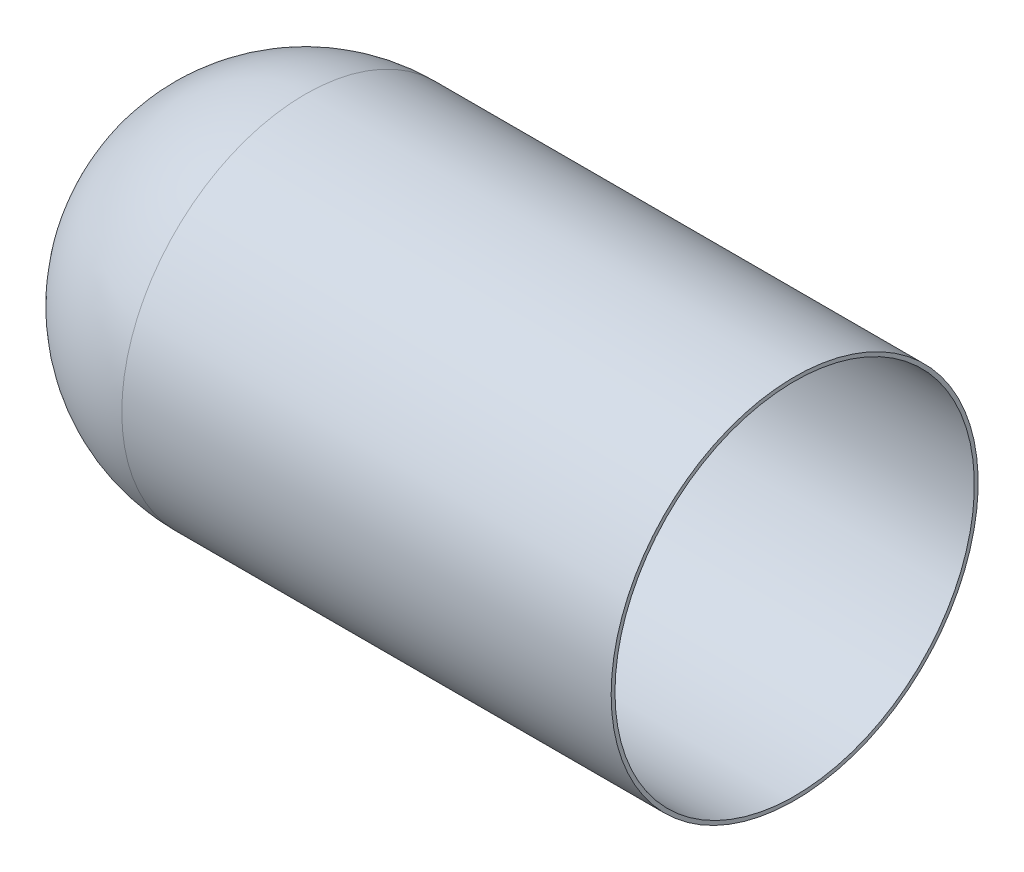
from build123d import *


with BuildPart() as part:
    # Sketch1 → Revolve1 (revolve)
    with BuildSketch(Plane.XY):
        with BuildLine():
            Line((0, 149.225), (-406.4, 149.225))
            ThreePointArc((-406.4, 149.225), (-487.083740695, 125.531807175), (-542.146366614, 61.976))
            ThreePointArc((-542.146366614, 61.976), (-552.216412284, 31.712371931), (-555.625, 0))
            Line((-555.625, 0), (-558.8, 0))
            ThreePointArc((-558.8, 0), (-555.392241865, 32.047961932), (-545.321366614, 62.662699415))
            ThreePointArc((-545.321366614, 62.662699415), (-489.092093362, 128.014755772), (-406.4, 152.4))
            Line((-406.4, 152.4), (0, 152.4))
            Line((0, 152.4), (0, 149.225))
        make_face()
    revolve(axis=Axis((0, 0, 0), (1, 0, 0)))

    # Sketch7 → Revolve2 (revolve)
    with BuildSketch(Plane.XY, mode=Mode.PRIVATE) as revolve2_sk:
        with BuildLine():
            Line((-546.1, 52.459609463), (-546.1, 0))
            Line((-546.1, 0), (-555.625, 0))
            ThreePointArc((-555.625, 0), (-553.224441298, 26.658658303), (-546.1, 52.459609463))
        make_face()
    revolve(revolve2_sk.sketch.rotate(Axis((0, 0, 0), (-1, 0, 0)), 270), axis=Axis((0, 0, 0), (-1, 0, 0)))


solid = part.part
